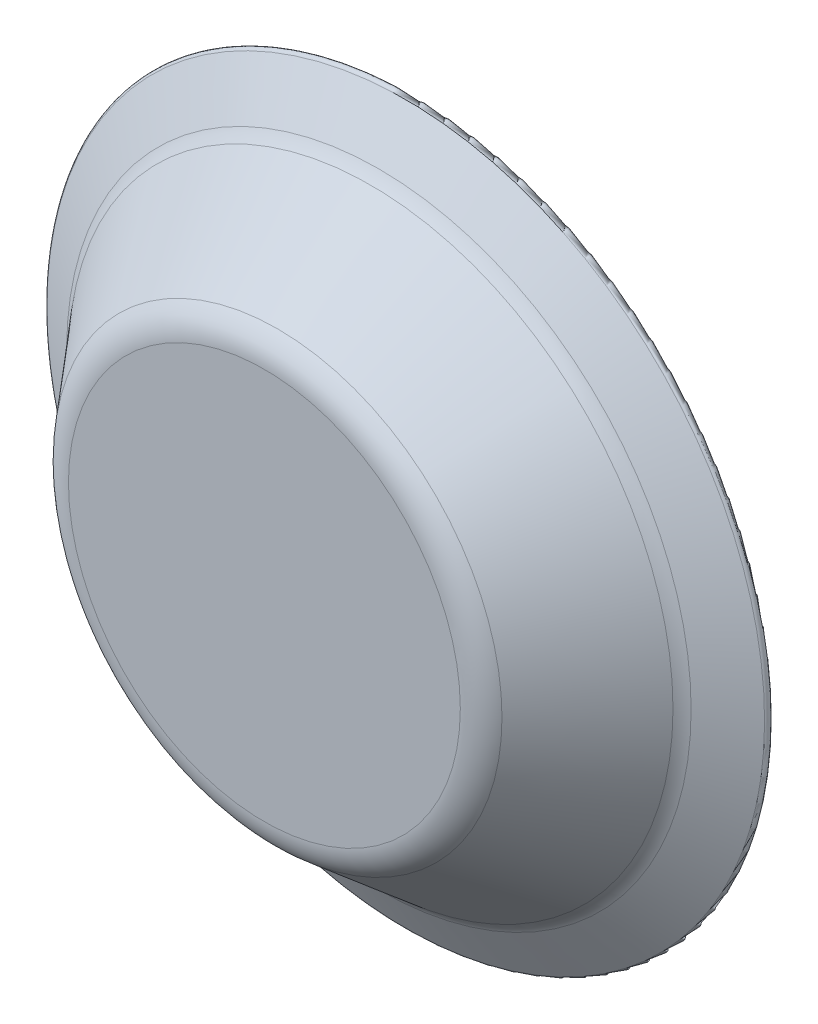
ISO-10303-21;
HEADER;
FILE_DESCRIPTION(('STEP AP214'),'2;1');
FILE_NAME('part.step','',(''),(''),'','','');
FILE_SCHEMA(('AUTOMOTIVE_DESIGN { 1 0 10303 214 1 1 1 1 }'));
ENDSEC;
DATA;
#1=APPLICATION_CONTEXT('core data for automotive mechanical design processes');
#2=APPLICATION_PROTOCOL_DEFINITION('international standard','automotive_design',2000,#1);
#3=PRODUCT_CONTEXT('',#1,'mechanical');
#4=PRODUCT('Part','Part','',(#3));
#5=PRODUCT_RELATED_PRODUCT_CATEGORY('part','',(#4));
#6=PRODUCT_DEFINITION_FORMATION('','',#4);
#7=PRODUCT_DEFINITION_CONTEXT('part definition',#1,'design');
#8=PRODUCT_DEFINITION('design','',#6,#7);
#9=PRODUCT_DEFINITION_SHAPE('','',#8);
#10=(LENGTH_UNIT() NAMED_UNIT(*) SI_UNIT(.MILLI.,.METRE.));
#11=(NAMED_UNIT(*) PLANE_ANGLE_UNIT() SI_UNIT($,.RADIAN.));
#12=(NAMED_UNIT(*) SI_UNIT($,.STERADIAN.) SOLID_ANGLE_UNIT());
#13=UNCERTAINTY_MEASURE_WITH_UNIT(LENGTH_MEASURE(1.E-05),#10,'distance_accuracy_value','');
#14=(GEOMETRIC_REPRESENTATION_CONTEXT(3) GLOBAL_UNCERTAINTY_ASSIGNED_CONTEXT((#13)) GLOBAL_UNIT_ASSIGNED_CONTEXT((#10,
#11,#12)) REPRESENTATION_CONTEXT('',''));
#15=CARTESIAN_POINT('',(0.,0.,0.));
#16=DIRECTION('',(0.,0.,1.));
#17=DIRECTION('',(1.,0.,0.));
#18=AXIS2_PLACEMENT_3D('',#15,#16,#17);
#19=CARTESIAN_POINT('',(0.,0.,0.));
#20=DIRECTION('',(0.,0.,-1.));
#21=DIRECTION('',(1.,0.,0.));
#22=AXIS2_PLACEMENT_3D('',#19,#20,#21);
#23=CONICAL_SURFACE('',#22,100.,1.0471975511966);
#24=CARTESIAN_POINT('',(0.,0.,9.11836509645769));
#25=DIRECTION('',(0.,0.,-1.));
#26=DIRECTION('',(-1.,0.,0.));
#27=AXIS2_PLACEMENT_3D('',#24,#25,#26);
#28=CIRCLE('',#27,84.2065283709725);
#29=CARTESIAN_POINT('',(-84.2065283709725,0.,9.11836509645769));
#30=VERTEX_POINT('',#29);
#31=EDGE_CURVE('E10',#30,#30,#28,.T.);
#32=ORIENTED_EDGE('',*,*,#31,.T.);
#33=EDGE_LOOP('',(#32));
#34=FACE_BOUND('',#33,.T.);
#35=CARTESIAN_POINT('',(0.,0.,1.86602540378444));
#36=DIRECTION('',(0.,0.,1.));
#37=DIRECTION('',(1.,0.,0.));
#38=AXIS2_PLACEMENT_3D('',#35,#36,#37);
#39=CIRCLE('',#38,96.7679491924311);
#40=CARTESIAN_POINT('',(96.7679491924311,0.,1.86602540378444));
#41=VERTEX_POINT('',#40);
#42=EDGE_CURVE('E56',#41,#41,#39,.T.);
#43=ORIENTED_EDGE('',*,*,#42,.T.);
#44=EDGE_LOOP('',(#43));
#45=FACE_BOUND('',#44,.T.);
#46=ADVANCED_FACE('F33',(#34,#45),#23,.T.);
#47=CARTESIAN_POINT('',(0.,0.,0.));
#48=DIRECTION('',(0.,0.,1.));
#49=DIRECTION('',(1.,0.,0.));
#50=AXIS2_PLACEMENT_3D('',#47,#48,#49);
#51=PLANE('',#50);
#52=CARTESIAN_POINT('',(0.,0.,0.));
#53=DIRECTION('',(0.,0.,1.));
#54=DIRECTION('',(1.,0.,0.));
#55=AXIS2_PLACEMENT_3D('',#52,#53,#54);
#56=CIRCLE('',#55,79.9999999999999);
#57=CARTESIAN_POINT('',(79.9999999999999,0.,0.));
#58=VERTEX_POINT('',#57);
#59=EDGE_CURVE('E60',#58,#58,#56,.T.);
#60=ORIENTED_EDGE('',*,*,#59,.T.);
#61=EDGE_LOOP('',(#60));
#62=FACE_BOUND('',#61,.T.);
#63=CARTESIAN_POINT('',(0.,0.,0.));
#64=DIRECTION('',(0.,0.,1.));
#65=DIRECTION('',(1.,0.,0.));
#66=AXIS2_PLACEMENT_3D('',#63,#64,#65);
#67=CIRCLE('',#66,96.2679491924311);
#68=CARTESIAN_POINT('',(96.2679491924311,0.,0.));
#69=VERTEX_POINT('',#68);
#70=EDGE_CURVE('E53',#69,#69,#67,.F.);
#71=ORIENTED_EDGE('',*,*,#70,.T.);
#72=EDGE_LOOP('',(#71));
#73=FACE_BOUND('',#72,.T.);
#74=ADVANCED_FACE('F82',(#62,#73),#51,.F.);
#75=CARTESIAN_POINT('',(0.,0.,10.));
#76=DIRECTION('',(0.,0.,-1.));
#77=DIRECTION('',(1.,0.,0.));
#78=AXIS2_PLACEMENT_3D('',#75,#76,#77);
#79=CONICAL_SURFACE('',#78,82.6794919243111,0.698131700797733);
#80=CARTESIAN_POINT('',(0.,0.,36.4278760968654));
#81=DIRECTION('',(0.,0.,-1.));
#82=DIRECTION('',(-1.,0.,0.));
#83=AXIS2_PLACEMENT_3D('',#80,#81,#82);
#84=CIRCLE('',#83,60.5038708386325);
#85=CARTESIAN_POINT('',(-60.5038708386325,0.,36.4278760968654));
#86=VERTEX_POINT('',#85);
#87=EDGE_CURVE('E40',#86,#86,#84,.T.);
#88=ORIENTED_EDGE('',*,*,#87,.T.);
#89=EDGE_LOOP('',(#88));
#90=FACE_BOUND('',#89,.T.);
#91=CARTESIAN_POINT('',(0.,0.,11.3507430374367));
#92=DIRECTION('',(0.,0.,-1.));
#93=DIRECTION('',(-1.,0.,0.));
#94=AXIS2_PLACEMENT_3D('',#91,#92,#93);
#95=CIRCLE('',#94,81.5460839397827);
#96=CARTESIAN_POINT('',(-81.5460839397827,0.,11.3507430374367));
#97=VERTEX_POINT('',#96);
#98=EDGE_CURVE('E44',#97,#97,#95,.F.);
#99=ORIENTED_EDGE('',*,*,#98,.T.);
#100=EDGE_LOOP('',(#99));
#101=FACE_BOUND('',#100,.T.);
#102=ADVANCED_FACE('F85',(#90,#101),#79,.T.);
#103=CARTESIAN_POINT('',(0.,0.,40.));
#104=DIRECTION('',(0.,0.,1.));
#105=DIRECTION('',(1.,0.,0.));
#106=AXIS2_PLACEMENT_3D('',#103,#104,#105);
#107=PLANE('',#106);
#108=CARTESIAN_POINT('',(0.,0.,40.));
#109=DIRECTION('',(0.,0.,1.));
#110=DIRECTION('',(1.,0.,0.));
#111=AXIS2_PLACEMENT_3D('',#108,#109,#110);
#112=CIRCLE('',#111,52.8434264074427);
#113=CARTESIAN_POINT('',(52.8434264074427,0.,40.));
#114=VERTEX_POINT('',#113);
#115=EDGE_CURVE('E48',#114,#114,#112,.T.);
#116=ORIENTED_EDGE('',*,*,#115,.T.);
#117=EDGE_LOOP('',(#116));
#118=FACE_BOUND('',#117,.T.);
#119=ADVANCED_FACE('F93',(#118),#107,.T.);
#120=CARTESIAN_POINT('',(0.,0.,1.));
#121=DIRECTION('',(0.,0.,1.));
#122=DIRECTION('',(1.,0.,0.));
#123=AXIS2_PLACEMENT_3D('',#120,#121,#122);
#124=TOROIDAL_SURFACE('',#123,96.2679491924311,1.);
#125=ORIENTED_EDGE('',*,*,#70,.F.);
#126=EDGE_LOOP('',(#125));
#127=FACE_BOUND('',#126,.T.);
#128=ORIENTED_EDGE('',*,*,#42,.F.);
#129=EDGE_LOOP('',(#128));
#130=FACE_BOUND('',#129,.T.);
#131=ADVANCED_FACE('F89',(#127,#130),#124,.T.);
#132=CARTESIAN_POINT('',(0.,0.,30.));
#133=DIRECTION('',(0.,0.,1.));
#134=DIRECTION('',(1.,0.,0.));
#135=AXIS2_PLACEMENT_3D('',#132,#133,#134);
#136=TOROIDAL_SURFACE('',#135,52.8434264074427,10.);
#137=ORIENTED_EDGE('',*,*,#87,.F.);
#138=EDGE_LOOP('',(#137));
#139=FACE_BOUND('',#138,.T.);
#140=ORIENTED_EDGE('',*,*,#115,.F.);
#141=EDGE_LOOP('',(#140));
#142=FACE_BOUND('',#141,.T.);
#143=ADVANCED_FACE('F92',(#139,#142),#136,.T.);
#144=CARTESIAN_POINT('',(0.,0.,17.7786191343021));
#145=DIRECTION('',(0.,0.,1.));
#146=DIRECTION('',(1.,0.,0.));
#147=AXIS2_PLACEMENT_3D('',#144,#145,#146);
#148=TOROIDAL_SURFACE('',#147,89.2065283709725,10.);
#149=ORIENTED_EDGE('',*,*,#31,.F.);
#150=EDGE_LOOP('',(#149));
#151=FACE_BOUND('',#150,.T.);
#152=ORIENTED_EDGE('',*,*,#98,.F.);
#153=EDGE_LOOP('',(#152));
#154=FACE_BOUND('',#153,.T.);
#155=ADVANCED_FACE('F35',(#151,#154),#148,.F.);
#156=CARTESIAN_POINT('',(0.,0.,-8.6602540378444));
#157=DIRECTION('',(0.,0.,-1.));
#158=DIRECTION('',(1.,0.,0.));
#159=AXIS2_PLACEMENT_3D('',#156,#157,#158);
#160=CONICAL_SURFACE('',#159,95.,1.0471975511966);
#161=CARTESIAN_POINT('',(0.,0.,0.458111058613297));
#162=DIRECTION('',(0.,0.,-1.));
#163=DIRECTION('',(-1.,0.,0.));
#164=AXIS2_PLACEMENT_3D('',#161,#162,#163);
#165=CIRCLE('',#164,79.2065283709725);
#166=CARTESIAN_POINT('',(-79.2065283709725,0.,0.458111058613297));
#167=VERTEX_POINT('',#166);
#168=EDGE_CURVE('E59',#167,#167,#165,.T.);
#169=ORIENTED_EDGE('',*,*,#168,.F.);
#170=EDGE_LOOP('',(#169));
#171=FACE_BOUND('',#170,.T.);
#172=ORIENTED_EDGE('',*,*,#59,.F.);
#173=EDGE_LOOP('',(#172));
#174=FACE_BOUND('',#173,.T.);
#175=ADVANCED_FACE('F75',(#171,#174),#160,.F.);
#176=CARTESIAN_POINT('',(0.,0.,3.5721239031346));
#177=DIRECTION('',(0.,0.,-1.));
#178=DIRECTION('',(1.,0.,0.));
#179=AXIS2_PLACEMENT_3D('',#176,#177,#178);
#180=CONICAL_SURFACE('',#179,75.0190474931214,0.698131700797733);
#181=CARTESIAN_POINT('',(0.,0.,30.));
#182=DIRECTION('',(0.,0.,1.));
#183=DIRECTION('',(1.,0.,0.));
#184=AXIS2_PLACEMENT_3D('',#181,#182,#183);
#185=CIRCLE('',#184,52.8434264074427);
#186=CARTESIAN_POINT('',(52.8434264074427,0.,30.));
#187=VERTEX_POINT('',#186);
#188=EDGE_CURVE('E63',#187,#187,#185,.T.);
#189=ORIENTED_EDGE('',*,*,#188,.T.);
#190=EDGE_LOOP('',(#189));
#191=FACE_BOUND('',#190,.T.);
#192=CARTESIAN_POINT('',(0.,0.,4.92286694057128));
#193=DIRECTION('',(0.,0.,-1.));
#194=DIRECTION('',(-1.,0.,0.));
#195=AXIS2_PLACEMENT_3D('',#192,#193,#194);
#196=CIRCLE('',#195,73.885639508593);
#197=CARTESIAN_POINT('',(-73.885639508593,0.,4.92286694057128));
#198=VERTEX_POINT('',#197);
#199=EDGE_CURVE('E66',#198,#198,#196,.F.);
#200=ORIENTED_EDGE('',*,*,#199,.F.);
#201=EDGE_LOOP('',(#200));
#202=FACE_BOUND('',#201,.T.);
#203=ADVANCED_FACE('F78',(#191,#202),#180,.F.);
#204=CARTESIAN_POINT('',(0.,0.,30.));
#205=DIRECTION('',(0.,0.,1.));
#206=DIRECTION('',(1.,0.,0.));
#207=AXIS2_PLACEMENT_3D('',#204,#205,#206);
#208=PLANE('',#207);
#209=ORIENTED_EDGE('',*,*,#188,.F.);
#210=EDGE_LOOP('',(#209));
#211=FACE_BOUND('',#210,.T.);
#212=ADVANCED_FACE('F119',(#211),#208,.F.);
#213=CARTESIAN_POINT('',(0.,0.,17.7786191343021));
#214=DIRECTION('',(0.,0.,1.));
#215=DIRECTION('',(1.,0.,0.));
#216=AXIS2_PLACEMENT_3D('',#213,#214,#215);
#217=TOROIDAL_SURFACE('',#216,89.2065283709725,20.);
#218=ORIENTED_EDGE('',*,*,#168,.T.);
#219=EDGE_LOOP('',(#218));
#220=FACE_BOUND('',#219,.T.);
#221=ORIENTED_EDGE('',*,*,#199,.T.);
#222=EDGE_LOOP('',(#221));
#223=FACE_BOUND('',#222,.T.);
#224=ADVANCED_FACE('F72',(#220,#223),#217,.T.);
#225=CLOSED_SHELL('',(#46,#74,#102,#119,#131,#143,#155,#175,#203,#212,#224));
#226=MANIFOLD_SOLID_BREP('B2',#225);
#227=ADVANCED_BREP_SHAPE_REPRESENTATION('',(#18,#226),#14);
#228=SHAPE_DEFINITION_REPRESENTATION(#9,#227);
ENDSEC;
END-ISO-10303-21;
